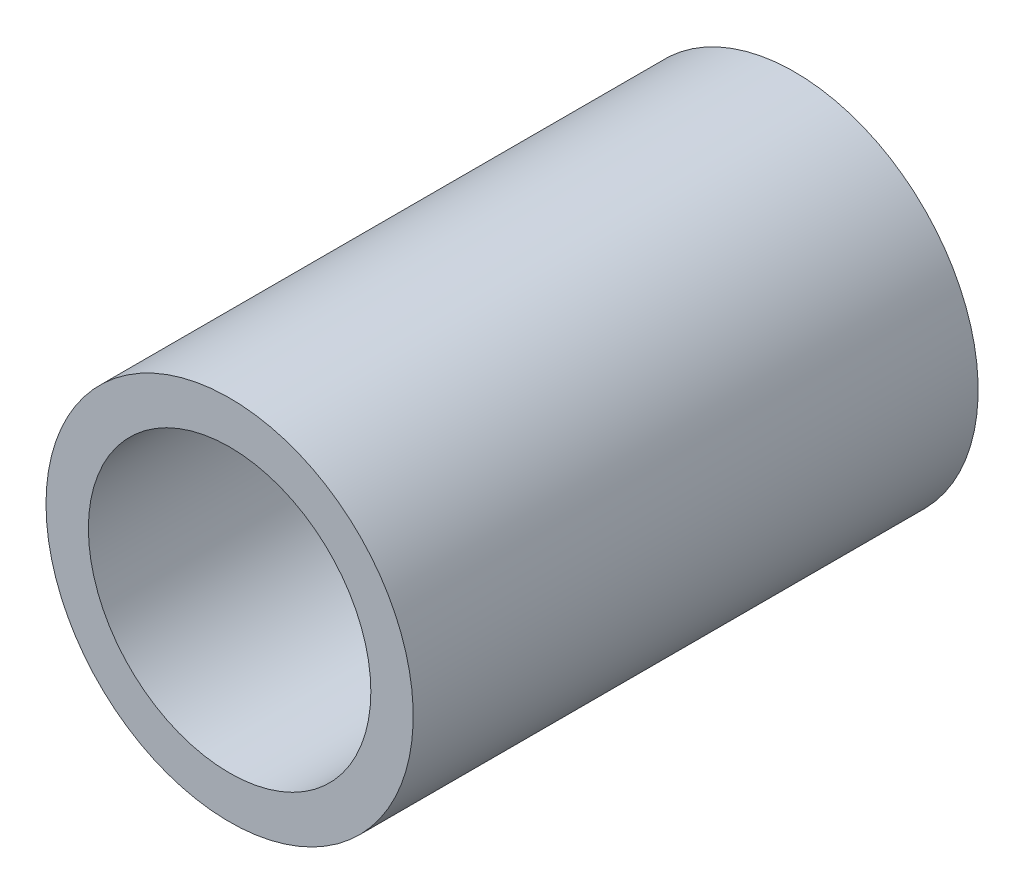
from build123d import *

# Parameters (mm, degrees)
ESQUISSE1_R        = 13
ESQUISSE1_R_2      = 10
BOSS_EXTRU_1_DEPTH = 40


with BuildPart() as part:
    # Esquisse1 → Boss.-Extru.1 (new body)
    with BuildSketch(Plane.XY):
        with Locations(Location((0, 0, 0), (0, 0, 180))):
            Circle(ESQUISSE1_R)
        with Locations(Location((0, 0, 0), (0, 0, 180))):
            Circle(ESQUISSE1_R_2, mode=Mode.SUBTRACT)
    extrude(amount=BOSS_EXTRU_1_DEPTH)


solid = part.part
